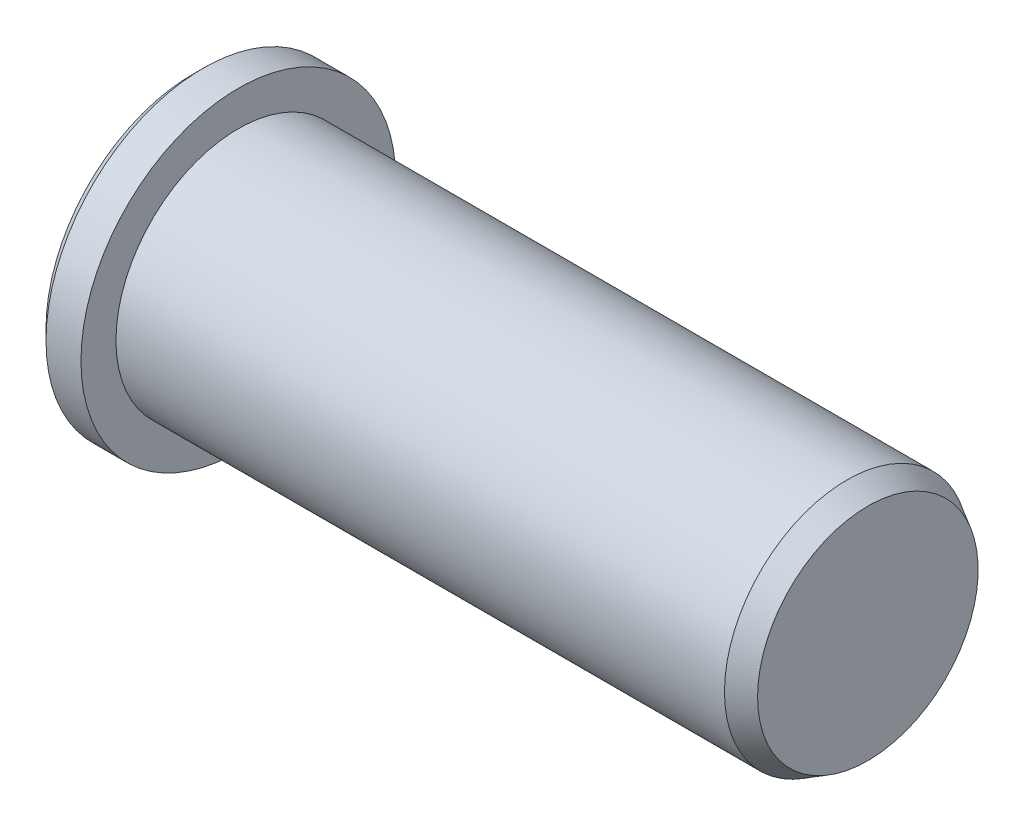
from build123d import *


with BuildPart() as part:
    # BodySke → BaseBody (revolve)
    with BuildSketch(Plane.XY, mode=Mode.PRIVATE) as basebody_sk:
        Polygon((0, 0), (0, 42), (3, 45), (13, 45), (13, 35), (187, 35), (193, 31.535898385), (193, 0), align=None)
    revolve(basebody_sk.sketch.rotate(Axis((0, 0, 0), (1, 0, 0)), 90), axis=Axis((0, 0, 0), (1, 0, 0)))


solid = part.part
